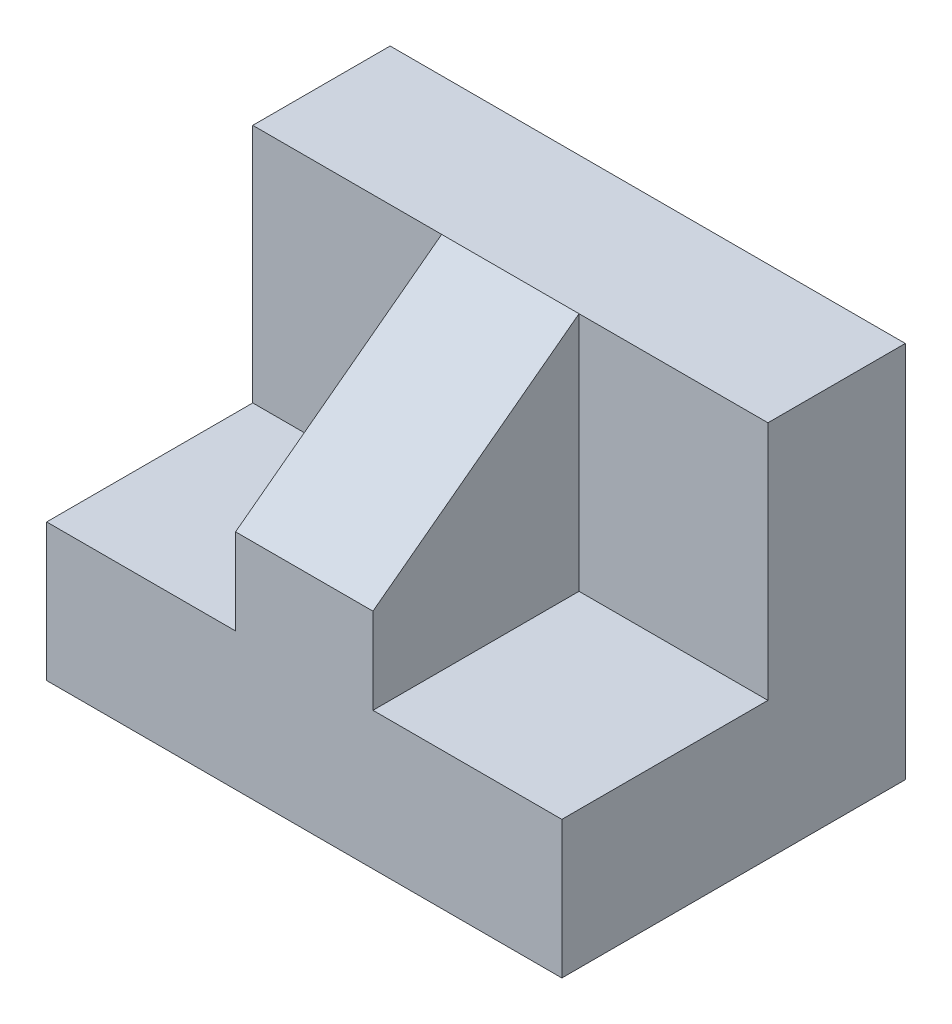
ISO-10303-21;
HEADER;
FILE_DESCRIPTION(('STEP AP214'),'2;1');
FILE_NAME('part.step','',(''),(''),'','','');
FILE_SCHEMA(('AUTOMOTIVE_DESIGN { 1 0 10303 214 1 1 1 1 }'));
ENDSEC;
DATA;
#1=APPLICATION_CONTEXT('core data for automotive mechanical design processes');
#2=APPLICATION_PROTOCOL_DEFINITION('international standard','automotive_design',2000,#1);
#3=PRODUCT_CONTEXT('',#1,'mechanical');
#4=PRODUCT('Part','Part','',(#3));
#5=PRODUCT_RELATED_PRODUCT_CATEGORY('part','',(#4));
#6=PRODUCT_DEFINITION_FORMATION('','',#4);
#7=PRODUCT_DEFINITION_CONTEXT('part definition',#1,'design');
#8=PRODUCT_DEFINITION('design','',#6,#7);
#9=PRODUCT_DEFINITION_SHAPE('','',#8);
#10=(LENGTH_UNIT() NAMED_UNIT(*) SI_UNIT(.MILLI.,.METRE.));
#11=(NAMED_UNIT(*) PLANE_ANGLE_UNIT() SI_UNIT($,.RADIAN.));
#12=(NAMED_UNIT(*) SI_UNIT($,.STERADIAN.) SOLID_ANGLE_UNIT());
#13=UNCERTAINTY_MEASURE_WITH_UNIT(LENGTH_MEASURE(1.E-05),#10,'distance_accuracy_value','');
#14=(GEOMETRIC_REPRESENTATION_CONTEXT(3) GLOBAL_UNCERTAINTY_ASSIGNED_CONTEXT((#13)) GLOBAL_UNIT_ASSIGNED_CONTEXT((#10,
#11,#12)) REPRESENTATION_CONTEXT('',''));
#15=CARTESIAN_POINT('',(0.,0.,0.));
#16=DIRECTION('',(0.,0.,1.));
#17=DIRECTION('',(1.,0.,0.));
#18=AXIS2_PLACEMENT_3D('',#15,#16,#17);
#19=CARTESIAN_POINT('',(0.,8.,-20.));
#20=DIRECTION('',(0.,-1.,0.));
#21=DIRECTION('',(0.,0.,-1.));
#22=AXIS2_PLACEMENT_3D('',#19,#20,#21);
#23=PLANE('',#22);
#24=DIRECTION('',(0.,0.,-1.));
#25=VECTOR('',#24,1.);
#26=CARTESIAN_POINT('',(19.,8.,0.));
#27=LINE('',#26,#25);
#28=CARTESIAN_POINT('',(19.,8.,0.));
#29=VERTEX_POINT('',#28);
#30=CARTESIAN_POINT('',(19.,8.,-12.));
#31=VERTEX_POINT('',#30);
#32=EDGE_CURVE('E126',#29,#31,#27,.T.);
#33=ORIENTED_EDGE('',*,*,#32,.F.);
#34=DIRECTION('',(1.,0.,0.));
#35=VECTOR('',#34,1.);
#36=CARTESIAN_POINT('',(0.,8.,0.));
#37=LINE('',#36,#35);
#38=CARTESIAN_POINT('',(30.,8.,0.));
#39=VERTEX_POINT('',#38);
#40=EDGE_CURVE('E131',#29,#39,#37,.T.);
#41=ORIENTED_EDGE('',*,*,#40,.T.);
#42=DIRECTION('',(0.,0.,-1.));
#43=VECTOR('',#42,1.);
#44=CARTESIAN_POINT('',(30.,8.,0.));
#45=LINE('',#44,#43);
#46=CARTESIAN_POINT('',(30.,8.,-12.));
#47=VERTEX_POINT('',#46);
#48=EDGE_CURVE('E166',#39,#47,#45,.T.);
#49=ORIENTED_EDGE('',*,*,#48,.T.);
#50=DIRECTION('',(1.,0.,0.));
#51=VECTOR('',#50,1.);
#52=CARTESIAN_POINT('',(0.,8.,-12.));
#53=LINE('',#52,#51);
#54=EDGE_CURVE('E35',#31,#47,#53,.T.);
#55=ORIENTED_EDGE('',*,*,#54,.F.);
#56=EDGE_LOOP('',(#33,#41,#49,#55));
#57=FACE_BOUND('',#56,.T.);
#58=ADVANCED_FACE('F31',(#57),#23,.F.);
#59=CARTESIAN_POINT('',(0.,22.,-12.));
#60=DIRECTION('',(0.,0.,-1.));
#61=DIRECTION('',(-1.,0.,0.));
#62=AXIS2_PLACEMENT_3D('',#59,#60,#61);
#63=PLANE('',#62);
#64=DIRECTION('',(0.,1.,0.));
#65=VECTOR('',#64,1.);
#66=CARTESIAN_POINT('',(19.,8.,-12.));
#67=LINE('',#66,#65);
#68=CARTESIAN_POINT('',(19.,22.,-12.));
#69=VERTEX_POINT('',#68);
#70=EDGE_CURVE('E49',#31,#69,#67,.T.);
#71=ORIENTED_EDGE('',*,*,#70,.F.);
#72=ORIENTED_EDGE('',*,*,#54,.T.);
#73=DIRECTION('',(0.,-1.,0.));
#74=VECTOR('',#73,1.);
#75=CARTESIAN_POINT('',(30.,22.,-12.));
#76=LINE('',#75,#74);
#77=CARTESIAN_POINT('',(30.,22.,-12.));
#78=VERTEX_POINT('',#77);
#79=EDGE_CURVE('E157',#78,#47,#76,.T.);
#80=ORIENTED_EDGE('',*,*,#79,.F.);
#81=DIRECTION('',(1.,0.,0.));
#82=VECTOR('',#81,1.);
#83=CARTESIAN_POINT('',(0.,22.,-12.));
#84=LINE('',#83,#82);
#85=EDGE_CURVE('E148',#69,#78,#84,.T.);
#86=ORIENTED_EDGE('',*,*,#85,.F.);
#87=EDGE_LOOP('',(#71,#72,#80,#86));
#88=FACE_BOUND('',#87,.T.);
#89=ADVANCED_FACE('F212',(#88),#63,.F.);
#90=CARTESIAN_POINT('',(0.,8.,0.));
#91=VERTEX_POINT('',#90);
#92=CARTESIAN_POINT('',(11.,8.,0.));
#93=VERTEX_POINT('',#92);
#94=EDGE_CURVE('E202',#91,#93,#37,.T.);
#95=ORIENTED_EDGE('',*,*,#94,.T.);
#96=DIRECTION('',(0.,0.,-1.));
#97=VECTOR('',#96,1.);
#98=CARTESIAN_POINT('',(11.,8.,0.));
#99=LINE('',#98,#97);
#100=CARTESIAN_POINT('',(11.,8.,-12.));
#101=VERTEX_POINT('',#100);
#102=EDGE_CURVE('E142',#93,#101,#99,.T.);
#103=ORIENTED_EDGE('',*,*,#102,.T.);
#104=CARTESIAN_POINT('',(0.,8.,-12.));
#105=VERTEX_POINT('',#104);
#106=EDGE_CURVE('E57',#105,#101,#53,.T.);
#107=ORIENTED_EDGE('',*,*,#106,.F.);
#108=DIRECTION('',(0.,0.,1.));
#109=VECTOR('',#108,1.);
#110=CARTESIAN_POINT('',(0.,8.,0.));
#111=LINE('',#110,#109);
#112=EDGE_CURVE('E193',#105,#91,#111,.T.);
#113=ORIENTED_EDGE('',*,*,#112,.T.);
#114=EDGE_LOOP('',(#95,#103,#107,#113));
#115=FACE_BOUND('',#114,.T.);
#116=ADVANCED_FACE('F220',(#115),#23,.F.);
#117=CARTESIAN_POINT('',(0.,8.,0.));
#118=DIRECTION('',(1.,0.,0.));
#119=DIRECTION('',(0.,0.,-1.));
#120=AXIS2_PLACEMENT_3D('',#117,#118,#119);
#121=PLANE('',#120);
#122=DIRECTION('',(0.,0.,1.));
#123=VECTOR('',#122,1.);
#124=CARTESIAN_POINT('',(0.,0.,0.));
#125=LINE('',#124,#123);
#126=CARTESIAN_POINT('',(0.,0.,-20.));
#127=VERTEX_POINT('',#126);
#128=CARTESIAN_POINT('',(0.,0.,0.));
#129=VERTEX_POINT('',#128);
#130=EDGE_CURVE('E175',#127,#129,#125,.T.);
#131=ORIENTED_EDGE('',*,*,#130,.T.);
#132=DIRECTION('',(0.,-1.,0.));
#133=VECTOR('',#132,1.);
#134=CARTESIAN_POINT('',(0.,8.,0.));
#135=LINE('',#134,#133);
#136=EDGE_CURVE('E11',#91,#129,#135,.T.);
#137=ORIENTED_EDGE('',*,*,#136,.F.);
#138=ORIENTED_EDGE('',*,*,#112,.F.);
#139=DIRECTION('',(0.,-1.,0.));
#140=VECTOR('',#139,1.);
#141=CARTESIAN_POINT('',(0.,22.,-12.));
#142=LINE('',#141,#140);
#143=CARTESIAN_POINT('',(0.,22.,-12.));
#144=VERTEX_POINT('',#143);
#145=EDGE_CURVE('E171',#144,#105,#142,.T.);
#146=ORIENTED_EDGE('',*,*,#145,.F.);
#147=DIRECTION('',(0.,0.,1.));
#148=VECTOR('',#147,1.);
#149=CARTESIAN_POINT('',(0.,22.,-20.));
#150=LINE('',#149,#148);
#151=CARTESIAN_POINT('',(0.,22.,-20.));
#152=VERTEX_POINT('',#151);
#153=EDGE_CURVE('E145',#152,#144,#150,.T.);
#154=ORIENTED_EDGE('',*,*,#153,.F.);
#155=DIRECTION('',(0.,-1.,0.));
#156=VECTOR('',#155,1.);
#157=CARTESIAN_POINT('',(0.,8.,-20.));
#158=LINE('',#157,#156);
#159=EDGE_CURVE('E194',#152,#127,#158,.T.);
#160=ORIENTED_EDGE('',*,*,#159,.T.);
#161=EDGE_LOOP('',(#131,#137,#138,#146,#154,#160));
#162=FACE_BOUND('',#161,.T.);
#163=ADVANCED_FACE('F33',(#162),#121,.F.);
#164=CARTESIAN_POINT('',(0.,8.,0.));
#165=DIRECTION('',(0.,0.,-1.));
#166=DIRECTION('',(-1.,0.,0.));
#167=AXIS2_PLACEMENT_3D('',#164,#165,#166);
#168=PLANE('',#167);
#169=DIRECTION('',(1.,0.,0.));
#170=VECTOR('',#169,1.);
#171=CARTESIAN_POINT('',(0.,0.,0.));
#172=LINE('',#171,#170);
#173=CARTESIAN_POINT('',(30.,0.,0.));
#174=VERTEX_POINT('',#173);
#175=EDGE_CURVE('E180',#129,#174,#172,.T.);
#176=ORIENTED_EDGE('',*,*,#175,.T.);
#177=DIRECTION('',(0.,-1.,0.));
#178=VECTOR('',#177,1.);
#179=CARTESIAN_POINT('',(30.,8.,0.));
#180=LINE('',#179,#178);
#181=EDGE_CURVE('E41',#39,#174,#180,.T.);
#182=ORIENTED_EDGE('',*,*,#181,.F.);
#183=ORIENTED_EDGE('',*,*,#40,.F.);
#184=DIRECTION('',(0.,-1.,0.));
#185=VECTOR('',#184,1.);
#186=CARTESIAN_POINT('',(19.,13.,0.));
#187=LINE('',#186,#185);
#188=CARTESIAN_POINT('',(19.,13.,0.));
#189=VERTEX_POINT('',#188);
#190=EDGE_CURVE('E113',#189,#29,#187,.T.);
#191=ORIENTED_EDGE('',*,*,#190,.F.);
#192=DIRECTION('',(-1.,0.,0.));
#193=VECTOR('',#192,1.);
#194=CARTESIAN_POINT('',(19.,13.,0.));
#195=LINE('',#194,#193);
#196=CARTESIAN_POINT('',(11.,13.,0.));
#197=VERTEX_POINT('',#196);
#198=EDGE_CURVE('E120',#189,#197,#195,.T.);
#199=ORIENTED_EDGE('',*,*,#198,.T.);
#200=DIRECTION('',(0.,-1.,0.));
#201=VECTOR('',#200,1.);
#202=CARTESIAN_POINT('',(11.,13.,0.));
#203=LINE('',#202,#201);
#204=EDGE_CURVE('E140',#197,#93,#203,.T.);
#205=ORIENTED_EDGE('',*,*,#204,.T.);
#206=ORIENTED_EDGE('',*,*,#94,.F.);
#207=ORIENTED_EDGE('',*,*,#136,.T.);
#208=EDGE_LOOP('',(#176,#182,#183,#191,#199,#205,#206,#207));
#209=FACE_BOUND('',#208,.T.);
#210=ADVANCED_FACE('F129',(#209),#168,.F.);
#211=CARTESIAN_POINT('',(30.,8.,0.));
#212=DIRECTION('',(-1.,0.,0.));
#213=DIRECTION('',(0.,0.,1.));
#214=AXIS2_PLACEMENT_3D('',#211,#212,#213);
#215=PLANE('',#214);
#216=DIRECTION('',(0.,0.,-1.));
#217=VECTOR('',#216,1.);
#218=CARTESIAN_POINT('',(30.,0.,0.));
#219=LINE('',#218,#217);
#220=CARTESIAN_POINT('',(30.,0.,-20.));
#221=VERTEX_POINT('',#220);
#222=EDGE_CURVE('E186',#174,#221,#219,.T.);
#223=ORIENTED_EDGE('',*,*,#222,.T.);
#224=DIRECTION('',(0.,-1.,0.));
#225=VECTOR('',#224,1.);
#226=CARTESIAN_POINT('',(30.,8.,-20.));
#227=LINE('',#226,#225);
#228=CARTESIAN_POINT('',(30.,22.,-20.));
#229=VERTEX_POINT('',#228);
#230=EDGE_CURVE('E196',#229,#221,#227,.T.);
#231=ORIENTED_EDGE('',*,*,#230,.F.);
#232=DIRECTION('',(0.,0.,-1.));
#233=VECTOR('',#232,1.);
#234=CARTESIAN_POINT('',(30.,22.,-20.));
#235=LINE('',#234,#233);
#236=EDGE_CURVE('E152',#78,#229,#235,.T.);
#237=ORIENTED_EDGE('',*,*,#236,.F.);
#238=ORIENTED_EDGE('',*,*,#79,.T.);
#239=ORIENTED_EDGE('',*,*,#48,.F.);
#240=ORIENTED_EDGE('',*,*,#181,.T.);
#241=EDGE_LOOP('',(#223,#231,#237,#238,#239,#240));
#242=FACE_BOUND('',#241,.T.);
#243=ADVANCED_FACE('F210',(#242),#215,.F.);
#244=CARTESIAN_POINT('',(0.,8.,-20.));
#245=DIRECTION('',(0.,0.,1.));
#246=DIRECTION('',(1.,0.,0.));
#247=AXIS2_PLACEMENT_3D('',#244,#245,#246);
#248=PLANE('',#247);
#249=DIRECTION('',(-1.,0.,0.));
#250=VECTOR('',#249,1.);
#251=CARTESIAN_POINT('',(0.,0.,-20.));
#252=LINE('',#251,#250);
#253=EDGE_CURVE('E191',#221,#127,#252,.T.);
#254=ORIENTED_EDGE('',*,*,#253,.T.);
#255=ORIENTED_EDGE('',*,*,#159,.F.);
#256=DIRECTION('',(-1.,0.,0.));
#257=VECTOR('',#256,1.);
#258=CARTESIAN_POINT('',(0.,22.,-20.));
#259=LINE('',#258,#257);
#260=EDGE_CURVE('E155',#229,#152,#259,.T.);
#261=ORIENTED_EDGE('',*,*,#260,.F.);
#262=ORIENTED_EDGE('',*,*,#230,.T.);
#263=EDGE_LOOP('',(#254,#255,#261,#262));
#264=FACE_BOUND('',#263,.T.);
#265=ADVANCED_FACE('F301',(#264),#248,.F.);
#266=CARTESIAN_POINT('',(0.,0.,-20.));
#267=DIRECTION('',(0.,-1.,0.));
#268=DIRECTION('',(0.,0.,-1.));
#269=AXIS2_PLACEMENT_3D('',#266,#267,#268);
#270=PLANE('',#269);
#271=ORIENTED_EDGE('',*,*,#130,.F.);
#272=ORIENTED_EDGE('',*,*,#253,.F.);
#273=ORIENTED_EDGE('',*,*,#222,.F.);
#274=ORIENTED_EDGE('',*,*,#175,.F.);
#275=EDGE_LOOP('',(#271,#272,#273,#274));
#276=FACE_BOUND('',#275,.T.);
#277=ADVANCED_FACE('F263',(#276),#270,.T.);
#278=ORIENTED_EDGE('',*,*,#106,.T.);
#279=DIRECTION('',(0.,1.,0.));
#280=VECTOR('',#279,1.);
#281=CARTESIAN_POINT('',(11.,8.,-12.));
#282=LINE('',#281,#280);
#283=CARTESIAN_POINT('',(11.,22.,-12.));
#284=VERTEX_POINT('',#283);
#285=EDGE_CURVE('E136',#101,#284,#282,.T.);
#286=ORIENTED_EDGE('',*,*,#285,.T.);
#287=EDGE_CURVE('E149',#144,#284,#84,.T.);
#288=ORIENTED_EDGE('',*,*,#287,.F.);
#289=ORIENTED_EDGE('',*,*,#145,.T.);
#290=EDGE_LOOP('',(#278,#286,#288,#289));
#291=FACE_BOUND('',#290,.T.);
#292=ADVANCED_FACE('F216',(#291),#63,.F.);
#293=CARTESIAN_POINT('',(0.,22.,-12.));
#294=DIRECTION('',(0.,1.,0.));
#295=DIRECTION('',(0.,0.,1.));
#296=AXIS2_PLACEMENT_3D('',#293,#294,#295);
#297=PLANE('',#296);
#298=ORIENTED_EDGE('',*,*,#153,.T.);
#299=ORIENTED_EDGE('',*,*,#287,.T.);
#300=DIRECTION('',(-1.,0.,0.));
#301=VECTOR('',#300,1.);
#302=CARTESIAN_POINT('',(19.,22.,-12.));
#303=LINE('',#302,#301);
#304=EDGE_CURVE('E125',#69,#284,#303,.T.);
#305=ORIENTED_EDGE('',*,*,#304,.F.);
#306=ORIENTED_EDGE('',*,*,#85,.T.);
#307=ORIENTED_EDGE('',*,*,#236,.T.);
#308=ORIENTED_EDGE('',*,*,#260,.T.);
#309=EDGE_LOOP('',(#298,#299,#305,#306,#307,#308));
#310=FACE_BOUND('',#309,.T.);
#311=ADVANCED_FACE('F215',(#310),#297,.T.);
#312=CARTESIAN_POINT('',(19.,22.,-12.));
#313=DIRECTION('',(0.,-0.8,-0.6));
#314=DIRECTION('',(0.,0.6,-0.8));
#315=AXIS2_PLACEMENT_3D('',#312,#313,#314);
#316=PLANE('',#315);
#317=DIRECTION('',(0.,-0.6,0.8));
#318=VECTOR('',#317,1.);
#319=CARTESIAN_POINT('',(11.,22.,-12.));
#320=LINE('',#319,#318);
#321=EDGE_CURVE('E122',#284,#197,#320,.T.);
#322=ORIENTED_EDGE('',*,*,#321,.T.);
#323=ORIENTED_EDGE('',*,*,#198,.F.);
#324=DIRECTION('',(0.,-0.6,0.8));
#325=VECTOR('',#324,1.);
#326=CARTESIAN_POINT('',(19.,22.,-12.));
#327=LINE('',#326,#325);
#328=EDGE_CURVE('E109',#69,#189,#327,.T.);
#329=ORIENTED_EDGE('',*,*,#328,.F.);
#330=ORIENTED_EDGE('',*,*,#304,.T.);
#331=EDGE_LOOP('',(#322,#323,#329,#330));
#332=FACE_BOUND('',#331,.T.);
#333=ADVANCED_FACE('F121',(#332),#316,.F.);
#334=CARTESIAN_POINT('',(19.,8.,-12.));
#335=DIRECTION('',(-1.,0.,0.));
#336=DIRECTION('',(0.,0.,1.));
#337=AXIS2_PLACEMENT_3D('',#334,#335,#336);
#338=PLANE('',#337);
#339=ORIENTED_EDGE('',*,*,#70,.T.);
#340=ORIENTED_EDGE('',*,*,#328,.T.);
#341=ORIENTED_EDGE('',*,*,#190,.T.);
#342=ORIENTED_EDGE('',*,*,#32,.T.);
#343=EDGE_LOOP('',(#339,#340,#341,#342));
#344=FACE_BOUND('',#343,.T.);
#345=ADVANCED_FACE('F111',(#344),#338,.F.);
#346=CARTESIAN_POINT('',(11.,8.,-12.));
#347=DIRECTION('',(-1.,0.,0.));
#348=DIRECTION('',(0.,0.,1.));
#349=AXIS2_PLACEMENT_3D('',#346,#347,#348);
#350=PLANE('',#349);
#351=ORIENTED_EDGE('',*,*,#285,.F.);
#352=ORIENTED_EDGE('',*,*,#102,.F.);
#353=ORIENTED_EDGE('',*,*,#204,.F.);
#354=ORIENTED_EDGE('',*,*,#321,.F.);
#355=EDGE_LOOP('',(#351,#352,#353,#354));
#356=FACE_BOUND('',#355,.T.);
#357=ADVANCED_FACE('F219',(#356),#350,.T.);
#358=CLOSED_SHELL('',(#58,#89,#116,#163,#210,#243,#265,#277,#292,#311,#333,#345,#357));
#359=MANIFOLD_SOLID_BREP('B2',#358);
#360=ADVANCED_BREP_SHAPE_REPRESENTATION('',(#18,#359),#14);
#361=SHAPE_DEFINITION_REPRESENTATION(#9,#360);
ENDSEC;
END-ISO-10303-21;
